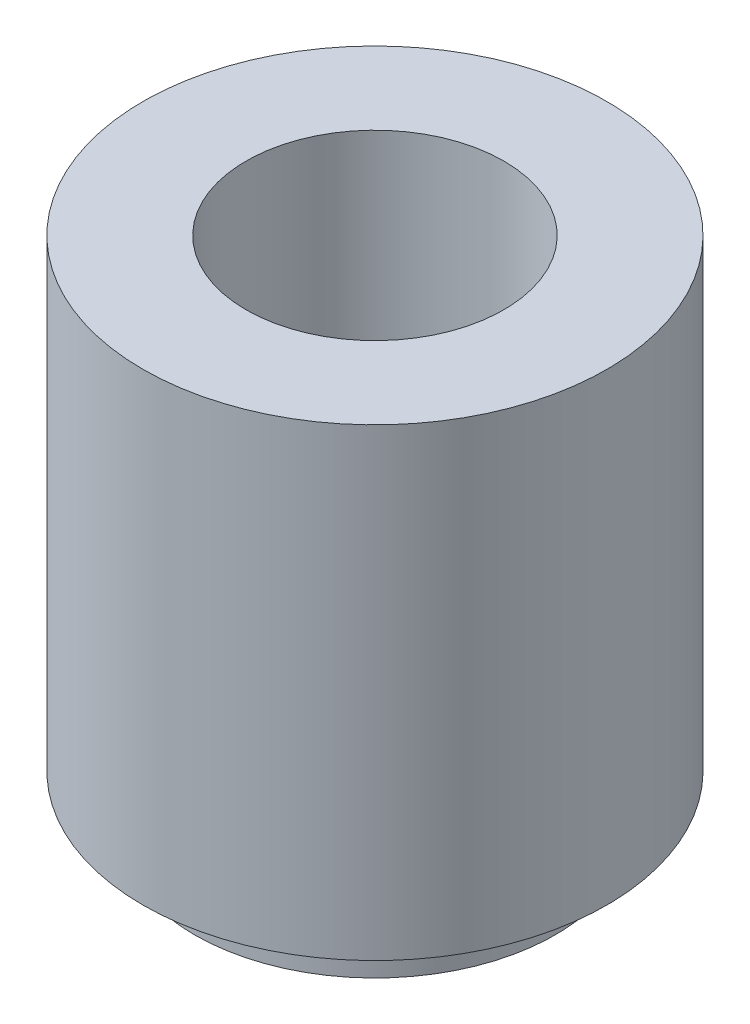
from build123d import *


with BuildPart() as part:
    # Esquisse1 → R_volution1 (revolve)
    with BuildSketch(Plane(origin=(0, 0, 0), x_dir=(-1, 0, 0), z_dir=(0, 0, -1)), mode=Mode.PRIVATE) as r_volution1_sk:
        Polygon((-3.5, -4), (-3.5, -5), (-2.5, -5), (-2.5, 5), (-4.5, 5), (-4.5, -4), align=None)
    revolve(r_volution1_sk.sketch.rotate(Axis((0, -5, 0), (0, 1, 0)), 270), axis=Axis((0, -5, 0), (0, 1, 0)))


solid = part.part
